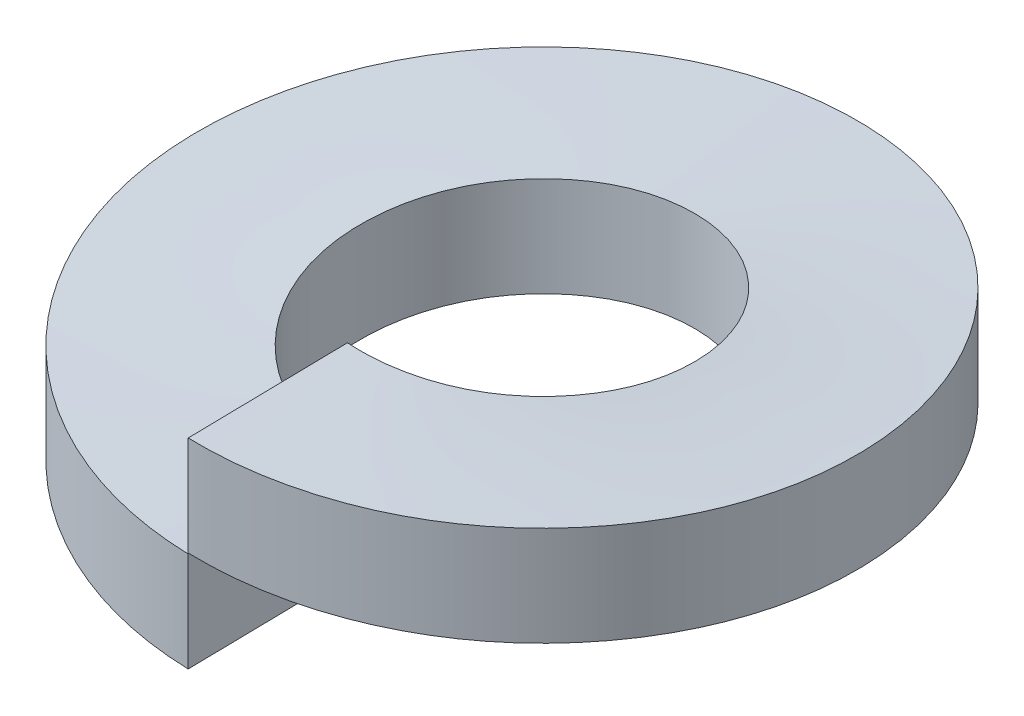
from build123d import *

# Parameters (mm, degrees)
SWEEP1_PITCH       = 1.2
SWEEP1_HEIGHT      = 1.2
SWEEP1_RADIUS      = 3.937
SWEEP1_START_ANGLE = 1
SKETCH2_W          = 1.936400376
SKETCH2_H          = 1.19


with BuildPart() as part:
    # Sweep1: sweep along a helix
    with BuildLine() as sweep1_path:
        add(Helix(SWEEP1_PITCH, SWEEP1_HEIGHT, SWEEP1_RADIUS, center=(0, 0, 0), direction=(0, 1, 0), lefthand=True, mode=Mode.PRIVATE).rotate(Axis((0, 0, 0), (0, 1, 0)), SWEEP1_START_ANGLE))
    # Sketch2 → Sweep1 (sweep)
    with BuildSketch(Plane(origin=(0, 0, 0), x_dir=(0, 0, -1), z_dir=(1, 0, 0))):
        with Locations((-2.968200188, 0.595)):
            Rectangle(SKETCH2_W, SKETCH2_H)
    sweep(path=sweep1_path.line, is_frenet=True)


solid = part.part
